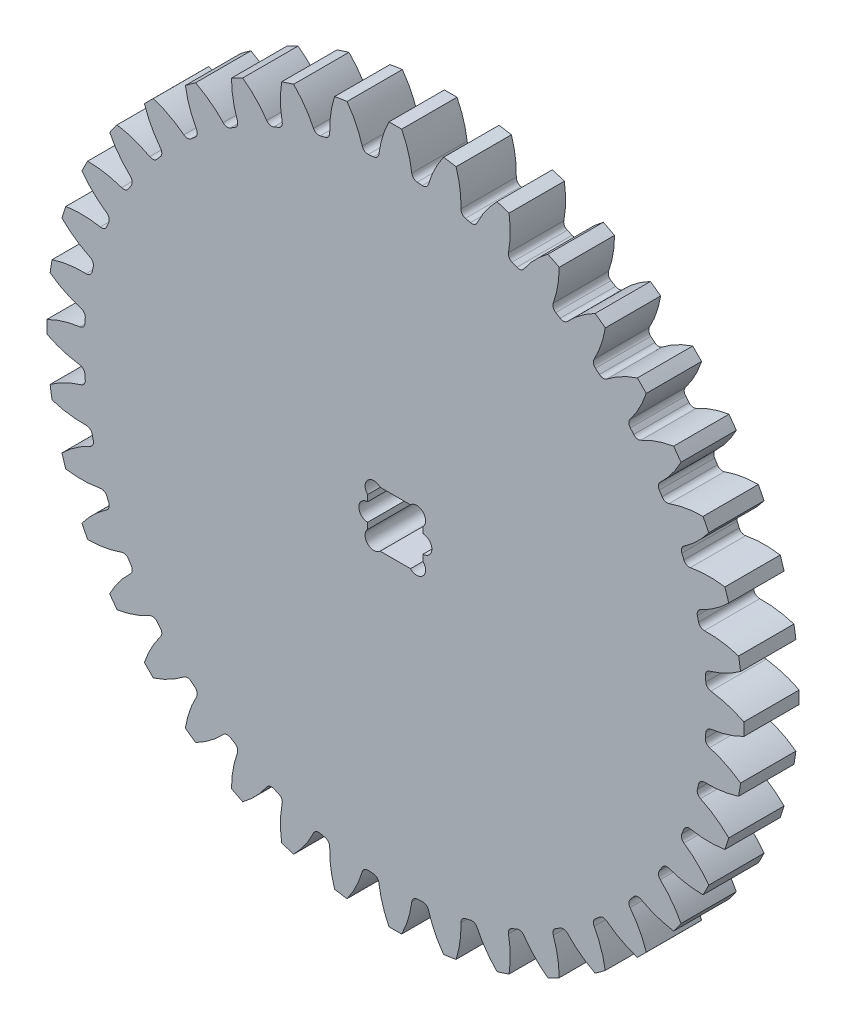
from build123d import *

# Parameters (mm, degrees)
BOSS_EXTRU_1_DEPTH                 = 10
CONG_1_R                           = 1.05
R_P_TITION_CIRCULAIRE4_COUNT       = 40
CONG_1_OF_R_P_TITION_CIRCULAIRE4_R = 1.05
ENL_V_MAT_EXTRU_1_DEPTH            = 92.019428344
ESQUISSE7_R                        = 1.6
ENL_V_MAT_EXTRU_2_DEPTH            = 8


with BuildPart() as part:
    # Esquisse3 → Boss.-Extru.1 (new body)
    with BuildSketch(Plane.XY):
        with BuildLine():
            Line((-5.792031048, 55.516247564), (-1.378706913, -0.560352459))
            Line((-1.378706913, -0.560352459), (3.034617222, 55.516247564))
            ThreePointArc((3.034617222, 55.516247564), (2.360175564, 55.565250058), (1.68519356, 55.606141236))
            ThreePointArc((1.68519356, 55.606141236), (1.058599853, 59.112109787), (-0.237772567, 62.429315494))
            ThreePointArc((-0.237772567, 62.429315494), (-1.378706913, 62.439647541), (-2.51964126, 62.429315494))
            ThreePointArc((-2.51964126, 62.429315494), (-3.816013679, 59.112109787), (-4.442607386, 55.606141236))
            ThreePointArc((-4.442607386, 55.606141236), (-5.11758939, 55.565250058), (-5.792031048, 55.516247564))
        make_face()
    boss_extru_1 = extrude(amount=BOSS_EXTRU_1_DEPTH)

    # Cong_1
    cong_1_edges = [part.edges().sort_by_distance(p)[0] for p in [
        (-4.442607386, 55.606141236, 5),
        (1.68519356, 55.606141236, 5),
    ]]
    fillet(cong_1_edges, radius=CONG_1_R)

    # R_p_tition circulaire4: Boss.-Extru.1 ×40 about axis
    r_p_tition_circulaire4_axis = Axis((-1.378706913, -0.560352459, 0), (0, 0, 1))
    for i in range(1, R_P_TITION_CIRCULAIRE4_COUNT):
        add(boss_extru_1.rotate(r_p_tition_circulaire4_axis, i * 360 / R_P_TITION_CIRCULAIRE4_COUNT))

    # Cong_1 of R_p_tition circulaire4
    cong_1_of_r_p_tition_circulaire4_edges = [part.edges().sort_by_distance(p)[0] for p in [
        (-13.191261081, 54.435338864, 5),
        (-7.138903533, 55.393938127, 5),
        (-21.649050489, 51.910360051, 5),
        (-15.821165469, 53.803954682, 5),
        (-29.607716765, 48.093378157, 5),
        (-24.147806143, 50.875341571, 5),
        (-36.871291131, 43.078379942, 5),
        (-31.913796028, 46.680210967, 5),
        (-43.260920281, 36.988851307, 5),
        (-38.927910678, 41.321860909, 5),
        (-48.619270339, 29.974736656, 5),
        (-45.017439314, 34.93223176, 5),
        (-52.814400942, 22.208746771, 5),
        (-50.032437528, 27.668657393, 5),
        (-55.743014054, 13.882106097, 5),
        (-53.849419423, 19.709991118, 5),
        (-57.332997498, 5.199844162, 5),
        (-56.374398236, 11.25220171, 5),
        (-57.545200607, -3.624252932, 5),
        (-57.545200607, 2.503548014, 5),
        (-56.374398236, -12.372906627, 5),
        (-57.332997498, -6.320549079, 5),
        (-53.849419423, -20.830696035, 5),
        (-55.743014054, -15.002811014, 5),
        (-50.032437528, -28.78936231, 5),
        (-52.814400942, -23.329451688, 5),
        (-45.017439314, -36.052936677, 5),
        (-48.619270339, -31.095441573, 5),
        (-38.927910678, -42.442565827, 5),
        (-43.260920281, -38.109556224, 5),
        (-31.913796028, -47.800915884, 5),
        (-36.871291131, -44.199084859, 5),
        (-24.147806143, -51.996046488, 5),
        (-29.607716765, -49.214083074, 5),
        (-15.821165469, -54.924659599, 5),
        (-21.649050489, -53.031064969, 5),
        (-7.138903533, -56.514643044, 5),
        (-13.191261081, -55.556043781, 5),
        (1.68519356, -56.726846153, 5),
        (-4.442607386, -56.726846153, 5),
        (10.433847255, -55.556043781, 5),
        (4.381489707, -56.514643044, 5),
        (18.891636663, -53.031064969, 5),
        (13.063751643, -54.924659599, 5),
        (26.850302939, -49.214083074, 5),
        (21.390392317, -51.996046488, 5),
        (34.113877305, -44.199084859, 5),
        (29.156382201, -47.800915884, 5),
        (40.503506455, -38.109556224, 5),
        (36.170496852, -42.442565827, 5),
        (45.861856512, -31.095441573, 5),
        (42.260025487, -36.052936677, 5),
        (50.056987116, -23.329451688, 5),
        (47.275023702, -28.78936231, 5),
        (52.985600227, -15.002811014, 5),
        (51.092005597, -20.830696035, 5),
        (54.575583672, -6.320549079, 5),
        (53.616984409, -12.372906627, 5),
        (54.787786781, 2.503548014, 5),
        (54.787786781, -3.624252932, 5),
        (53.616984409, 11.25220171, 5),
        (54.575583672, 5.199844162, 5),
        (51.092005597, 19.709991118, 5),
        (52.985600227, 13.882106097, 5),
        (47.275023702, 27.668657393, 5),
        (50.056987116, 22.208746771, 5),
        (42.260025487, 34.93223176, 5),
        (45.861856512, 29.974736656, 5),
        (36.170496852, 41.321860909, 5),
        (40.503506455, 36.988851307, 5),
        (29.156382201, 46.680210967, 5),
        (34.113877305, 43.078379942, 5),
        (21.390392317, 50.875341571, 5),
        (26.850302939, 48.093378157, 5),
        (13.063751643, 53.803954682, 5),
        (18.891636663, 51.910360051, 5),
        (4.381489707, 55.393938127, 5),
        (10.433847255, 54.435338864, 5),
    ]]
    fillet(cong_1_of_r_p_tition_circulaire4_edges, radius=CONG_1_OF_R_P_TITION_CIRCULAIRE4_R)

    # Esquisse6 → Enl_v. mat.-Extru.1 (cut, through all)
    with BuildSketch(Plane.XY.offset(10)):
        with BuildLine():
            Line((-4.115965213, 4.439647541), (1.358551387, 4.439647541))
            ThreePointArc((1.358551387, 4.439647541), (3.621293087, 4.439647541), (3.621293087, 2.176905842))
            Line((3.621293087, 2.176905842), (3.621293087, -3.297610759))
            ThreePointArc((3.621293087, -3.297610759), (3.621293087, -5.560352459), (1.358551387, -5.560352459))
            Line((1.358551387, -5.560352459), (-4.115965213, -5.560352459))
            ThreePointArc((-4.115965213, -5.560352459), (-6.378706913, -5.560352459), (-6.378706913, -3.297610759))
            Line((-6.378706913, -3.297610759), (-6.378706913, 2.176905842))
            ThreePointArc((-6.378706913, 2.176905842), (-6.378706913, 4.439647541), (-4.115965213, 4.439647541))
        make_face()
    extrude(amount=-ENL_V_MAT_EXTRU_1_DEPTH, mode=Mode.SUBTRACT)

    # Esquisse7 → Enl_v. mat.-Extru.2 (cut)
    with BuildSketch(Plane.XY.offset(10)):
        with Locations((3.621293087, -0.560352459)):
            Circle(ESQUISSE7_R)
        with Locations((-6.378706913, -0.560352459)):
            Circle(ESQUISSE7_R)
    extrude(amount=-ENL_V_MAT_EXTRU_2_DEPTH, mode=Mode.SUBTRACT)


solid = part.part
